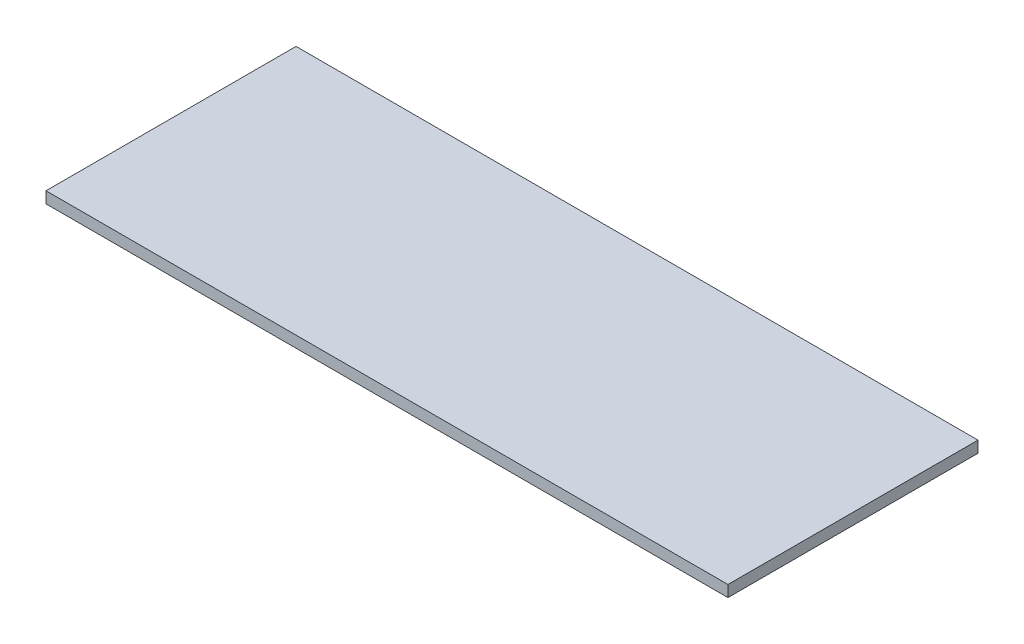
ISO-10303-21;
HEADER;
FILE_DESCRIPTION(('STEP AP214'),'2;1');
FILE_NAME('part.step','',(''),(''),'','','');
FILE_SCHEMA(('AUTOMOTIVE_DESIGN { 1 0 10303 214 1 1 1 1 }'));
ENDSEC;
DATA;
#1=APPLICATION_CONTEXT('core data for automotive mechanical design processes');
#2=APPLICATION_PROTOCOL_DEFINITION('international standard','automotive_design',2000,#1);
#3=PRODUCT_CONTEXT('',#1,'mechanical');
#4=PRODUCT('Part','Part','',(#3));
#5=PRODUCT_RELATED_PRODUCT_CATEGORY('part','',(#4));
#6=PRODUCT_DEFINITION_FORMATION('','',#4);
#7=PRODUCT_DEFINITION_CONTEXT('part definition',#1,'design');
#8=PRODUCT_DEFINITION('design','',#6,#7);
#9=PRODUCT_DEFINITION_SHAPE('','',#8);
#10=(LENGTH_UNIT() NAMED_UNIT(*) SI_UNIT(.MILLI.,.METRE.));
#11=(NAMED_UNIT(*) PLANE_ANGLE_UNIT() SI_UNIT($,.RADIAN.));
#12=(NAMED_UNIT(*) SI_UNIT($,.STERADIAN.) SOLID_ANGLE_UNIT());
#13=UNCERTAINTY_MEASURE_WITH_UNIT(LENGTH_MEASURE(1.E-05),#10,'distance_accuracy_value','');
#14=(GEOMETRIC_REPRESENTATION_CONTEXT(3) GLOBAL_UNCERTAINTY_ASSIGNED_CONTEXT((#13)) GLOBAL_UNIT_ASSIGNED_CONTEXT((#10,
#11,#12)) REPRESENTATION_CONTEXT('',''));
#15=CARTESIAN_POINT('',(0.,0.,0.));
#16=DIRECTION('',(0.,0.,1.));
#17=DIRECTION('',(1.,0.,0.));
#18=AXIS2_PLACEMENT_3D('',#15,#16,#17);
#19=CARTESIAN_POINT('',(-150.,-5.,55.));
#20=DIRECTION('',(-1.,0.,0.));
#21=DIRECTION('',(0.,0.,1.));
#22=AXIS2_PLACEMENT_3D('',#19,#20,#21);
#23=PLANE('',#22);
#24=DIRECTION('',(0.,0.,1.));
#25=VECTOR('',#24,1.);
#26=CARTESIAN_POINT('',(-150.,0.,55.));
#27=LINE('',#26,#25);
#28=CARTESIAN_POINT('',(-150.,0.,-55.));
#29=VERTEX_POINT('',#28);
#30=CARTESIAN_POINT('',(-150.,0.,55.));
#31=VERTEX_POINT('',#30);
#32=EDGE_CURVE('E105',#29,#31,#27,.T.);
#33=ORIENTED_EDGE('',*,*,#32,.F.);
#34=DIRECTION('',(0.,1.,0.));
#35=VECTOR('',#34,1.);
#36=CARTESIAN_POINT('',(-150.,-5.,-55.));
#37=LINE('',#36,#35);
#38=CARTESIAN_POINT('',(-150.,-5.,-55.));
#39=VERTEX_POINT('',#38);
#40=EDGE_CURVE('E11',#39,#29,#37,.T.);
#41=ORIENTED_EDGE('',*,*,#40,.F.);
#42=DIRECTION('',(0.,0.,1.));
#43=VECTOR('',#42,1.);
#44=CARTESIAN_POINT('',(-150.,-5.,55.));
#45=LINE('',#44,#43);
#46=CARTESIAN_POINT('',(-150.,-5.,55.));
#47=VERTEX_POINT('',#46);
#48=EDGE_CURVE('E96',#39,#47,#45,.T.);
#49=ORIENTED_EDGE('',*,*,#48,.T.);
#50=DIRECTION('',(0.,1.,0.));
#51=VECTOR('',#50,1.);
#52=CARTESIAN_POINT('',(-150.,-5.,55.));
#53=LINE('',#52,#51);
#54=EDGE_CURVE('E40',#47,#31,#53,.T.);
#55=ORIENTED_EDGE('',*,*,#54,.T.);
#56=EDGE_LOOP('',(#33,#41,#49,#55));
#57=FACE_BOUND('',#56,.T.);
#58=ADVANCED_FACE('F37',(#57),#23,.T.);
#59=CARTESIAN_POINT('',(150.,-5.,-55.));
#60=DIRECTION('',(0.,0.,-1.));
#61=DIRECTION('',(-1.,0.,0.));
#62=AXIS2_PLACEMENT_3D('',#59,#60,#61);
#63=PLANE('',#62);
#64=DIRECTION('',(-1.,0.,0.));
#65=VECTOR('',#64,1.);
#66=CARTESIAN_POINT('',(150.,0.,-55.));
#67=LINE('',#66,#65);
#68=CARTESIAN_POINT('',(150.,0.,-55.));
#69=VERTEX_POINT('',#68);
#70=EDGE_CURVE('E100',#69,#29,#67,.T.);
#71=ORIENTED_EDGE('',*,*,#70,.F.);
#72=DIRECTION('',(0.,1.,0.));
#73=VECTOR('',#72,1.);
#74=CARTESIAN_POINT('',(150.,-5.,-55.));
#75=LINE('',#74,#73);
#76=CARTESIAN_POINT('',(150.,-5.,-55.));
#77=VERTEX_POINT('',#76);
#78=EDGE_CURVE('E46',#77,#69,#75,.T.);
#79=ORIENTED_EDGE('',*,*,#78,.F.);
#80=DIRECTION('',(-1.,0.,0.));
#81=VECTOR('',#80,1.);
#82=CARTESIAN_POINT('',(150.,-5.,-55.));
#83=LINE('',#82,#81);
#84=EDGE_CURVE('E92',#77,#39,#83,.T.);
#85=ORIENTED_EDGE('',*,*,#84,.T.);
#86=ORIENTED_EDGE('',*,*,#40,.T.);
#87=EDGE_LOOP('',(#71,#79,#85,#86));
#88=FACE_BOUND('',#87,.T.);
#89=ADVANCED_FACE('F115',(#88),#63,.T.);
#90=CARTESIAN_POINT('',(150.,-5.,55.));
#91=DIRECTION('',(1.,0.,0.));
#92=DIRECTION('',(0.,0.,-1.));
#93=AXIS2_PLACEMENT_3D('',#90,#91,#92);
#94=PLANE('',#93);
#95=DIRECTION('',(0.,0.,-1.));
#96=VECTOR('',#95,1.);
#97=CARTESIAN_POINT('',(150.,0.,55.));
#98=LINE('',#97,#96);
#99=CARTESIAN_POINT('',(150.,0.,55.));
#100=VERTEX_POINT('',#99);
#101=EDGE_CURVE('E87',#100,#69,#98,.T.);
#102=ORIENTED_EDGE('',*,*,#101,.F.);
#103=DIRECTION('',(0.,1.,0.));
#104=VECTOR('',#103,1.);
#105=CARTESIAN_POINT('',(150.,-5.,55.));
#106=LINE('',#105,#104);
#107=CARTESIAN_POINT('',(150.,-5.,55.));
#108=VERTEX_POINT('',#107);
#109=EDGE_CURVE('E82',#108,#100,#106,.T.);
#110=ORIENTED_EDGE('',*,*,#109,.F.);
#111=DIRECTION('',(0.,0.,-1.));
#112=VECTOR('',#111,1.);
#113=CARTESIAN_POINT('',(150.,-5.,55.));
#114=LINE('',#113,#112);
#115=EDGE_CURVE('E85',#108,#77,#114,.T.);
#116=ORIENTED_EDGE('',*,*,#115,.T.);
#117=ORIENTED_EDGE('',*,*,#78,.T.);
#118=EDGE_LOOP('',(#102,#110,#116,#117));
#119=FACE_BOUND('',#118,.T.);
#120=ADVANCED_FACE('F84',(#119),#94,.T.);
#121=CARTESIAN_POINT('',(150.,-5.,55.));
#122=DIRECTION('',(0.,0.,1.));
#123=DIRECTION('',(1.,0.,0.));
#124=AXIS2_PLACEMENT_3D('',#121,#122,#123);
#125=PLANE('',#124);
#126=DIRECTION('',(1.,0.,0.));
#127=VECTOR('',#126,1.);
#128=CARTESIAN_POINT('',(150.,0.,55.));
#129=LINE('',#128,#127);
#130=EDGE_CURVE('E108',#31,#100,#129,.T.);
#131=ORIENTED_EDGE('',*,*,#130,.F.);
#132=ORIENTED_EDGE('',*,*,#54,.F.);
#133=DIRECTION('',(1.,0.,0.));
#134=VECTOR('',#133,1.);
#135=CARTESIAN_POINT('',(150.,-5.,55.));
#136=LINE('',#135,#134);
#137=EDGE_CURVE('E91',#47,#108,#136,.T.);
#138=ORIENTED_EDGE('',*,*,#137,.T.);
#139=ORIENTED_EDGE('',*,*,#109,.T.);
#140=EDGE_LOOP('',(#131,#132,#138,#139));
#141=FACE_BOUND('',#140,.T.);
#142=ADVANCED_FACE('F94',(#141),#125,.T.);
#143=CARTESIAN_POINT('',(0.,-5.,0.));
#144=DIRECTION('',(0.,1.,0.));
#145=DIRECTION('',(0.,0.,1.));
#146=AXIS2_PLACEMENT_3D('',#143,#144,#145);
#147=PLANE('',#146);
#148=ORIENTED_EDGE('',*,*,#48,.F.);
#149=ORIENTED_EDGE('',*,*,#84,.F.);
#150=ORIENTED_EDGE('',*,*,#115,.F.);
#151=ORIENTED_EDGE('',*,*,#137,.F.);
#152=EDGE_LOOP('',(#148,#149,#150,#151));
#153=FACE_BOUND('',#152,.T.);
#154=ADVANCED_FACE('F90',(#153),#147,.F.);
#155=CARTESIAN_POINT('',(0.,0.,0.));
#156=DIRECTION('',(0.,1.,0.));
#157=DIRECTION('',(0.,0.,1.));
#158=AXIS2_PLACEMENT_3D('',#155,#156,#157);
#159=PLANE('',#158);
#160=ORIENTED_EDGE('',*,*,#32,.T.);
#161=ORIENTED_EDGE('',*,*,#130,.T.);
#162=ORIENTED_EDGE('',*,*,#101,.T.);
#163=ORIENTED_EDGE('',*,*,#70,.T.);
#164=EDGE_LOOP('',(#160,#161,#162,#163));
#165=FACE_BOUND('',#164,.T.);
#166=ADVANCED_FACE('F114',(#165),#159,.T.);
#167=CLOSED_SHELL('',(#58,#89,#120,#142,#154,#166));
#168=MANIFOLD_SOLID_BREP('B2',#167);
#169=ADVANCED_BREP_SHAPE_REPRESENTATION('',(#18,#168),#14);
#170=SHAPE_DEFINITION_REPRESENTATION(#9,#169);
ENDSEC;
END-ISO-10303-21;
